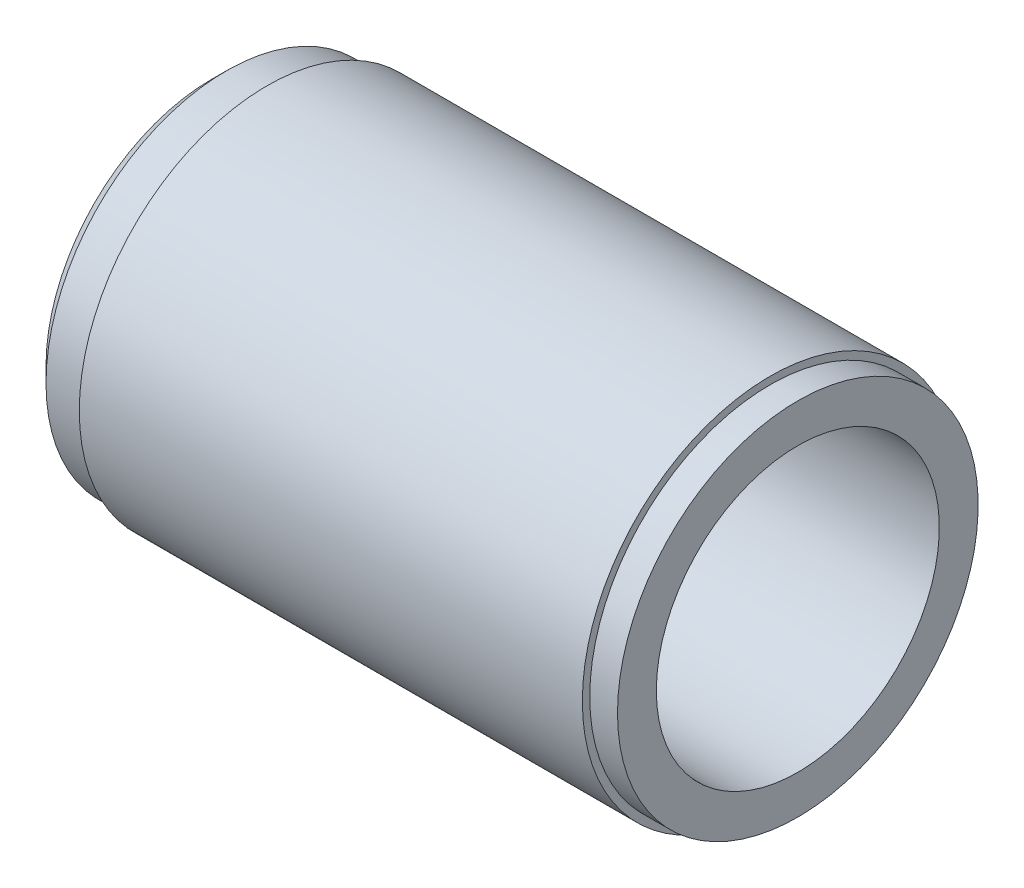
ISO-10303-21;
HEADER;
FILE_DESCRIPTION(('STEP AP214'),'2;1');
FILE_NAME('part.step','',(''),(''),'','','');
FILE_SCHEMA(('AUTOMOTIVE_DESIGN { 1 0 10303 214 1 1 1 1 }'));
ENDSEC;
DATA;
#1=APPLICATION_CONTEXT('core data for automotive mechanical design processes');
#2=APPLICATION_PROTOCOL_DEFINITION('international standard','automotive_design',2000,#1);
#3=PRODUCT_CONTEXT('',#1,'mechanical');
#4=PRODUCT('Part','Part','',(#3));
#5=PRODUCT_RELATED_PRODUCT_CATEGORY('part','',(#4));
#6=PRODUCT_DEFINITION_FORMATION('','',#4);
#7=PRODUCT_DEFINITION_CONTEXT('part definition',#1,'design');
#8=PRODUCT_DEFINITION('design','',#6,#7);
#9=PRODUCT_DEFINITION_SHAPE('','',#8);
#10=(LENGTH_UNIT() NAMED_UNIT(*) SI_UNIT(.MILLI.,.METRE.));
#11=(NAMED_UNIT(*) PLANE_ANGLE_UNIT() SI_UNIT($,.RADIAN.));
#12=(NAMED_UNIT(*) SI_UNIT($,.STERADIAN.) SOLID_ANGLE_UNIT());
#13=UNCERTAINTY_MEASURE_WITH_UNIT(LENGTH_MEASURE(1.E-05),#10,'distance_accuracy_value','');
#14=(GEOMETRIC_REPRESENTATION_CONTEXT(3) GLOBAL_UNCERTAINTY_ASSIGNED_CONTEXT((#13)) GLOBAL_UNIT_ASSIGNED_CONTEXT((#10,
#11,#12)) REPRESENTATION_CONTEXT('',''));
#15=CARTESIAN_POINT('',(0.,0.,0.));
#16=DIRECTION('',(0.,0.,1.));
#17=DIRECTION('',(1.,0.,0.));
#18=AXIS2_PLACEMENT_3D('',#15,#16,#17);
#19=CARTESIAN_POINT('',(302.,101.5,0.));
#20=DIRECTION('',(-1.,0.,0.));
#21=DIRECTION('',(0.,0.,1.));
#22=AXIS2_PLACEMENT_3D('',#19,#20,#21);
#23=PLANE('',#22);
#24=CARTESIAN_POINT('',(302.,0.,0.));
#25=DIRECTION('',(-1.,0.,0.));
#26=DIRECTION('',(0.,0.,1.));
#27=AXIS2_PLACEMENT_3D('',#24,#25,#26);
#28=CIRCLE('',#27,101.5);
#29=CARTESIAN_POINT('',(302.,0.,101.5));
#30=VERTEX_POINT('',#29);
#31=EDGE_CURVE('E10',#30,#30,#28,.T.);
#32=ORIENTED_EDGE('',*,*,#31,.F.);
#33=EDGE_LOOP('',(#32));
#34=FACE_BOUND('',#33,.T.);
#35=CARTESIAN_POINT('',(302.,0.,0.));
#36=DIRECTION('',(-1.,0.,0.));
#37=DIRECTION('',(0.,0.,1.));
#38=AXIS2_PLACEMENT_3D('',#35,#36,#37);
#39=CIRCLE('',#38,97.5);
#40=CARTESIAN_POINT('',(302.,0.,97.5));
#41=VERTEX_POINT('',#40);
#42=EDGE_CURVE('E66',#41,#41,#39,.T.);
#43=ORIENTED_EDGE('',*,*,#42,.T.);
#44=EDGE_LOOP('',(#43));
#45=FACE_BOUND('',#44,.T.);
#46=ADVANCED_FACE('F35',(#34,#45),#23,.F.);
#47=CARTESIAN_POINT('',(0.,0.,0.));
#48=DIRECTION('',(-1.,0.,0.));
#49=DIRECTION('',(0.,0.,1.));
#50=AXIS2_PLACEMENT_3D('',#47,#48,#49);
#51=CYLINDRICAL_SURFACE('',#50,101.5);
#52=CARTESIAN_POINT('',(30.,0.,0.));
#53=DIRECTION('',(-1.,0.,0.));
#54=DIRECTION('',(0.,0.,1.));
#55=AXIS2_PLACEMENT_3D('',#52,#53,#54);
#56=CIRCLE('',#55,101.5);
#57=CARTESIAN_POINT('',(30.,0.,101.5));
#58=VERTEX_POINT('',#57);
#59=EDGE_CURVE('E41',#58,#58,#56,.T.);
#60=ORIENTED_EDGE('',*,*,#59,.F.);
#61=EDGE_LOOP('',(#60));
#62=FACE_BOUND('',#61,.T.);
#63=ORIENTED_EDGE('',*,*,#31,.T.);
#64=EDGE_LOOP('',(#63));
#65=FACE_BOUND('',#64,.T.);
#66=ADVANCED_FACE('F109',(#62,#65),#51,.T.);
#67=CARTESIAN_POINT('',(30.,97.5,0.));
#68=DIRECTION('',(1.,0.,0.));
#69=DIRECTION('',(0.,0.,-1.));
#70=AXIS2_PLACEMENT_3D('',#67,#68,#69);
#71=PLANE('',#70);
#72=CARTESIAN_POINT('',(30.,0.,0.));
#73=DIRECTION('',(-1.,0.,0.));
#74=DIRECTION('',(0.,0.,1.));
#75=AXIS2_PLACEMENT_3D('',#72,#73,#74);
#76=CIRCLE('',#75,97.5);
#77=CARTESIAN_POINT('',(30.,0.,97.5));
#78=VERTEX_POINT('',#77);
#79=EDGE_CURVE('E45',#78,#78,#76,.T.);
#80=ORIENTED_EDGE('',*,*,#79,.F.);
#81=EDGE_LOOP('',(#80));
#82=FACE_BOUND('',#81,.T.);
#83=ORIENTED_EDGE('',*,*,#59,.T.);
#84=EDGE_LOOP('',(#83));
#85=FACE_BOUND('',#84,.T.);
#86=ADVANCED_FACE('F104',(#82,#85),#71,.F.);
#87=CARTESIAN_POINT('',(0.,0.,0.));
#88=DIRECTION('',(-1.,0.,0.));
#89=DIRECTION('',(0.,0.,1.));
#90=AXIS2_PLACEMENT_3D('',#87,#88,#89);
#91=CYLINDRICAL_SURFACE('',#90,97.5);
#92=CARTESIAN_POINT('',(8.00000000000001,0.,0.));
#93=DIRECTION('',(-1.,0.,0.));
#94=DIRECTION('',(0.,0.,1.));
#95=AXIS2_PLACEMENT_3D('',#92,#93,#94);
#96=CIRCLE('',#95,97.5);
#97=CARTESIAN_POINT('',(8.00000000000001,0.,97.5));
#98=VERTEX_POINT('',#97);
#99=EDGE_CURVE('E49',#98,#98,#96,.T.);
#100=ORIENTED_EDGE('',*,*,#99,.F.);
#101=EDGE_LOOP('',(#100));
#102=FACE_BOUND('',#101,.T.);
#103=ORIENTED_EDGE('',*,*,#79,.T.);
#104=EDGE_LOOP('',(#103));
#105=FACE_BOUND('',#104,.T.);
#106=ADVANCED_FACE('F98',(#102,#105),#91,.T.);
#107=CARTESIAN_POINT('',(8.00000000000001,0.,0.));
#108=DIRECTION('',(1.,0.,0.));
#109=DIRECTION('',(0.,0.,-1.));
#110=AXIS2_PLACEMENT_3D('',#107,#108,#109);
#111=CONICAL_SURFACE('',#110,97.5,0.785398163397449);
#112=CARTESIAN_POINT('',(0.,0.,0.));
#113=DIRECTION('',(-1.,0.,0.));
#114=DIRECTION('',(0.,0.,1.));
#115=AXIS2_PLACEMENT_3D('',#112,#113,#114);
#116=CIRCLE('',#115,89.5);
#117=CARTESIAN_POINT('',(0.,0.,89.5));
#118=VERTEX_POINT('',#117);
#119=EDGE_CURVE('E54',#118,#118,#116,.T.);
#120=ORIENTED_EDGE('',*,*,#119,.F.);
#121=EDGE_LOOP('',(#120));
#122=FACE_BOUND('',#121,.T.);
#123=ORIENTED_EDGE('',*,*,#99,.T.);
#124=EDGE_LOOP('',(#123));
#125=FACE_BOUND('',#124,.T.);
#126=ADVANCED_FACE('F92',(#122,#125),#111,.T.);
#127=CARTESIAN_POINT('',(0.,76.5,0.));
#128=DIRECTION('',(1.,0.,0.));
#129=DIRECTION('',(0.,0.,-1.));
#130=AXIS2_PLACEMENT_3D('',#127,#128,#129);
#131=PLANE('',#130);
#132=CARTESIAN_POINT('',(0.,0.,0.));
#133=DIRECTION('',(-1.,0.,0.));
#134=DIRECTION('',(0.,0.,1.));
#135=AXIS2_PLACEMENT_3D('',#132,#133,#134);
#136=CIRCLE('',#135,76.5);
#137=CARTESIAN_POINT('',(0.,0.,76.5));
#138=VERTEX_POINT('',#137);
#139=EDGE_CURVE('E57',#138,#138,#136,.T.);
#140=ORIENTED_EDGE('',*,*,#139,.F.);
#141=EDGE_LOOP('',(#140));
#142=FACE_BOUND('',#141,.T.);
#143=ORIENTED_EDGE('',*,*,#119,.T.);
#144=EDGE_LOOP('',(#143));
#145=FACE_BOUND('',#144,.T.);
#146=ADVANCED_FACE('F86',(#142,#145),#131,.F.);
#147=CARTESIAN_POINT('',(0.,0.,0.));
#148=DIRECTION('',(-1.,0.,0.));
#149=DIRECTION('',(0.,0.,1.));
#150=AXIS2_PLACEMENT_3D('',#147,#148,#149);
#151=CYLINDRICAL_SURFACE('',#150,76.5);
#152=CARTESIAN_POINT('',(317.,0.,0.));
#153=DIRECTION('',(-1.,0.,0.));
#154=DIRECTION('',(0.,0.,1.));
#155=AXIS2_PLACEMENT_3D('',#152,#153,#154);
#156=CIRCLE('',#155,76.5);
#157=CARTESIAN_POINT('',(317.,0.,76.5));
#158=VERTEX_POINT('',#157);
#159=EDGE_CURVE('E60',#158,#158,#156,.T.);
#160=ORIENTED_EDGE('',*,*,#159,.F.);
#161=EDGE_LOOP('',(#160));
#162=FACE_BOUND('',#161,.T.);
#163=ORIENTED_EDGE('',*,*,#139,.T.);
#164=EDGE_LOOP('',(#163));
#165=FACE_BOUND('',#164,.T.);
#166=ADVANCED_FACE('F80',(#162,#165),#151,.F.);
#167=CARTESIAN_POINT('',(317.,97.5,0.));
#168=DIRECTION('',(-1.,0.,0.));
#169=DIRECTION('',(0.,0.,1.));
#170=AXIS2_PLACEMENT_3D('',#167,#168,#169);
#171=PLANE('',#170);
#172=CARTESIAN_POINT('',(317.,0.,0.));
#173=DIRECTION('',(-1.,0.,0.));
#174=DIRECTION('',(0.,0.,1.));
#175=AXIS2_PLACEMENT_3D('',#172,#173,#174);
#176=CIRCLE('',#175,97.5);
#177=CARTESIAN_POINT('',(317.,0.,97.5));
#178=VERTEX_POINT('',#177);
#179=EDGE_CURVE('E63',#178,#178,#176,.T.);
#180=ORIENTED_EDGE('',*,*,#179,.F.);
#181=EDGE_LOOP('',(#180));
#182=FACE_BOUND('',#181,.T.);
#183=ORIENTED_EDGE('',*,*,#159,.T.);
#184=EDGE_LOOP('',(#183));
#185=FACE_BOUND('',#184,.T.);
#186=ADVANCED_FACE('F74',(#182,#185),#171,.F.);
#187=CARTESIAN_POINT('',(0.,0.,0.));
#188=DIRECTION('',(-1.,0.,0.));
#189=DIRECTION('',(0.,0.,1.));
#190=AXIS2_PLACEMENT_3D('',#187,#188,#189);
#191=CYLINDRICAL_SURFACE('',#190,97.5);
#192=ORIENTED_EDGE('',*,*,#42,.F.);
#193=EDGE_LOOP('',(#192));
#194=FACE_BOUND('',#193,.T.);
#195=ORIENTED_EDGE('',*,*,#179,.T.);
#196=EDGE_LOOP('',(#195));
#197=FACE_BOUND('',#196,.T.);
#198=ADVANCED_FACE('F71',(#194,#197),#191,.T.);
#199=CLOSED_SHELL('',(#46,#66,#86,#106,#126,#146,#166,#186,#198));
#200=MANIFOLD_SOLID_BREP('B2',#199);
#201=ADVANCED_BREP_SHAPE_REPRESENTATION('',(#18,#200),#14);
#202=SHAPE_DEFINITION_REPRESENTATION(#9,#201);
ENDSEC;
END-ISO-10303-21;
